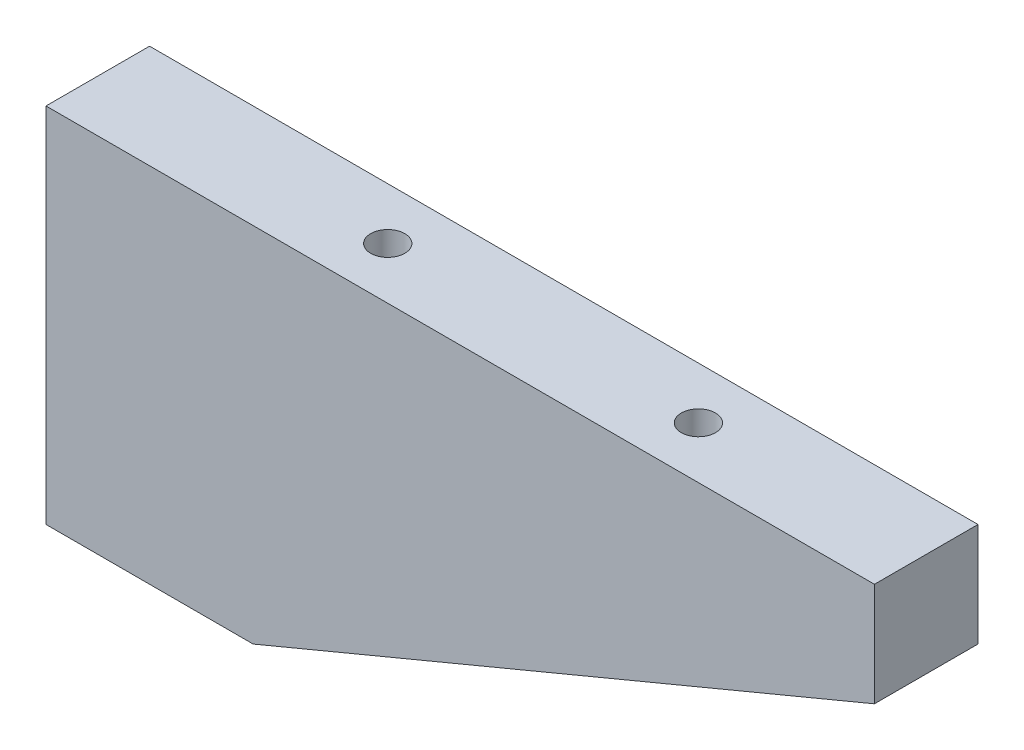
ISO-10303-21;
HEADER;
FILE_DESCRIPTION(('STEP AP214'),'2;1');
FILE_NAME('part.step','',(''),(''),'','','');
FILE_SCHEMA(('AUTOMOTIVE_DESIGN { 1 0 10303 214 1 1 1 1 }'));
ENDSEC;
DATA;
#1=APPLICATION_CONTEXT('core data for automotive mechanical design processes');
#2=APPLICATION_PROTOCOL_DEFINITION('international standard','automotive_design',2000,#1);
#3=PRODUCT_CONTEXT('',#1,'mechanical');
#4=PRODUCT('Part','Part','',(#3));
#5=PRODUCT_RELATED_PRODUCT_CATEGORY('part','',(#4));
#6=PRODUCT_DEFINITION_FORMATION('','',#4);
#7=PRODUCT_DEFINITION_CONTEXT('part definition',#1,'design');
#8=PRODUCT_DEFINITION('design','',#6,#7);
#9=PRODUCT_DEFINITION_SHAPE('','',#8);
#10=(LENGTH_UNIT() NAMED_UNIT(*) SI_UNIT(.MILLI.,.METRE.));
#11=(NAMED_UNIT(*) PLANE_ANGLE_UNIT() SI_UNIT($,.RADIAN.));
#12=(NAMED_UNIT(*) SI_UNIT($,.STERADIAN.) SOLID_ANGLE_UNIT());
#13=UNCERTAINTY_MEASURE_WITH_UNIT(LENGTH_MEASURE(1.E-05),#10,'distance_accuracy_value','');
#14=(GEOMETRIC_REPRESENTATION_CONTEXT(3) GLOBAL_UNCERTAINTY_ASSIGNED_CONTEXT((#13)) GLOBAL_UNIT_ASSIGNED_CONTEXT((#10,
#11,#12)) REPRESENTATION_CONTEXT('',''));
#15=CARTESIAN_POINT('',(0.,0.,0.));
#16=DIRECTION('',(0.,0.,1.));
#17=DIRECTION('',(1.,0.,0.));
#18=AXIS2_PLACEMENT_3D('',#15,#16,#17);
#19=CARTESIAN_POINT('',(0.,31.6094189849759,10.));
#20=DIRECTION('',(1.,0.,0.));
#21=DIRECTION('',(0.,1.,0.));
#22=AXIS2_PLACEMENT_3D('',#19,#20,#21);
#23=PLANE('',#22);
#24=CARTESIAN_POINT('',(0.,4.60941898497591,5.));
#25=DIRECTION('',(-1.,0.,0.));
#26=DIRECTION('',(0.,0.,1.));
#27=AXIS2_PLACEMENT_3D('',#24,#25,#26);
#28=CIRCLE('',#27,1.65);
#29=CARTESIAN_POINT('',(0.,4.60941898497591,6.65));
#30=VERTEX_POINT('',#29);
#31=EDGE_CURVE('E135',#30,#30,#28,.T.);
#32=ORIENTED_EDGE('',*,*,#31,.F.);
#33=EDGE_LOOP('',(#32));
#34=FACE_BOUND('',#33,.T.);
#35=CARTESIAN_POINT('',(0.,24.6094189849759,5.));
#36=DIRECTION('',(-1.,0.,0.));
#37=DIRECTION('',(0.,0.,1.));
#38=AXIS2_PLACEMENT_3D('',#35,#36,#37);
#39=CIRCLE('',#38,1.65);
#40=CARTESIAN_POINT('',(0.,24.6094189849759,6.65));
#41=VERTEX_POINT('',#40);
#42=EDGE_CURVE('E138',#41,#41,#39,.T.);
#43=ORIENTED_EDGE('',*,*,#42,.F.);
#44=EDGE_LOOP('',(#43));
#45=FACE_BOUND('',#44,.T.);
#46=DIRECTION('',(0.,-1.,0.));
#47=VECTOR('',#46,1.);
#48=CARTESIAN_POINT('',(0.,31.6094189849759,0.));
#49=LINE('',#48,#47);
#50=CARTESIAN_POINT('',(0.,31.6094189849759,0.));
#51=VERTEX_POINT('',#50);
#52=CARTESIAN_POINT('',(0.,-3.39058101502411,0.));
#53=VERTEX_POINT('',#52);
#54=EDGE_CURVE('E93',#51,#53,#49,.T.);
#55=ORIENTED_EDGE('',*,*,#54,.T.);
#56=DIRECTION('',(0.,0.,-1.));
#57=VECTOR('',#56,1.);
#58=CARTESIAN_POINT('',(0.,-3.39058101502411,10.));
#59=LINE('',#58,#57);
#60=CARTESIAN_POINT('',(0.,-3.39058101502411,10.));
#61=VERTEX_POINT('',#60);
#62=EDGE_CURVE('E11',#61,#53,#59,.T.);
#63=ORIENTED_EDGE('',*,*,#62,.F.);
#64=DIRECTION('',(0.,-1.,0.));
#65=VECTOR('',#64,1.);
#66=CARTESIAN_POINT('',(0.,31.6094189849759,10.));
#67=LINE('',#66,#65);
#68=CARTESIAN_POINT('',(0.,31.6094189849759,10.));
#69=VERTEX_POINT('',#68);
#70=EDGE_CURVE('E102',#69,#61,#67,.T.);
#71=ORIENTED_EDGE('',*,*,#70,.F.);
#72=DIRECTION('',(0.,0.,-1.));
#73=VECTOR('',#72,1.);
#74=CARTESIAN_POINT('',(0.,31.6094189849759,10.));
#75=LINE('',#74,#73);
#76=EDGE_CURVE('E89',#69,#51,#75,.T.);
#77=ORIENTED_EDGE('',*,*,#76,.T.);
#78=EDGE_LOOP('',(#55,#63,#71,#77));
#79=FACE_BOUND('',#78,.T.);
#80=ADVANCED_FACE('F16',(#34,#45,#79),#23,.F.);
#81=CARTESIAN_POINT('',(0.,-3.39058101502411,10.));
#82=DIRECTION('',(0.,1.,0.));
#83=DIRECTION('',(0.,0.,1.));
#84=AXIS2_PLACEMENT_3D('',#81,#82,#83);
#85=PLANE('',#84);
#86=DIRECTION('',(1.,0.,0.));
#87=VECTOR('',#86,1.);
#88=CARTESIAN_POINT('',(0.,-3.39058101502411,0.));
#89=LINE('',#88,#87);
#90=CARTESIAN_POINT('',(20.,-3.39058101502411,0.));
#91=VERTEX_POINT('',#90);
#92=EDGE_CURVE('E96',#53,#91,#89,.T.);
#93=ORIENTED_EDGE('',*,*,#92,.T.);
#94=DIRECTION('',(0.,0.,-1.));
#95=VECTOR('',#94,1.);
#96=CARTESIAN_POINT('',(20.,-3.39058101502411,10.));
#97=LINE('',#96,#95);
#98=CARTESIAN_POINT('',(20.,-3.39058101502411,10.));
#99=VERTEX_POINT('',#98);
#100=EDGE_CURVE('E24',#99,#91,#97,.T.);
#101=ORIENTED_EDGE('',*,*,#100,.F.);
#102=DIRECTION('',(1.,0.,0.));
#103=VECTOR('',#102,1.);
#104=CARTESIAN_POINT('',(0.,-3.39058101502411,10.));
#105=LINE('',#104,#103);
#106=EDGE_CURVE('E67',#61,#99,#105,.T.);
#107=ORIENTED_EDGE('',*,*,#106,.F.);
#108=ORIENTED_EDGE('',*,*,#62,.T.);
#109=EDGE_LOOP('',(#93,#101,#107,#108));
#110=FACE_BOUND('',#109,.T.);
#111=ADVANCED_FACE('F126',(#110),#85,.F.);
#112=CARTESIAN_POINT('',(80.,21.6094189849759,10.));
#113=DIRECTION('',(-0.384615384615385,0.923076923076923,0.));
#114=DIRECTION('',(-0.923076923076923,-0.384615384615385,0.));
#115=AXIS2_PLACEMENT_3D('',#112,#113,#114);
#116=PLANE('',#115);
#117=DIRECTION('',(0.923076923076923,0.384615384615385,0.));
#118=VECTOR('',#117,1.);
#119=CARTESIAN_POINT('',(80.,21.6094189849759,0.));
#120=LINE('',#119,#118);
#121=CARTESIAN_POINT('',(80.,21.6094189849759,0.));
#122=VERTEX_POINT('',#121);
#123=EDGE_CURVE('E84',#91,#122,#120,.T.);
#124=ORIENTED_EDGE('',*,*,#123,.T.);
#125=DIRECTION('',(0.,0.,-1.));
#126=VECTOR('',#125,1.);
#127=CARTESIAN_POINT('',(80.,21.6094189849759,10.));
#128=LINE('',#127,#126);
#129=CARTESIAN_POINT('',(80.,21.6094189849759,10.));
#130=VERTEX_POINT('',#129);
#131=EDGE_CURVE('E81',#130,#122,#128,.T.);
#132=ORIENTED_EDGE('',*,*,#131,.F.);
#133=DIRECTION('',(0.923076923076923,0.384615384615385,0.));
#134=VECTOR('',#133,1.);
#135=CARTESIAN_POINT('',(80.,21.6094189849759,10.));
#136=LINE('',#135,#134);
#137=EDGE_CURVE('E73',#99,#130,#136,.T.);
#138=ORIENTED_EDGE('',*,*,#137,.F.);
#139=ORIENTED_EDGE('',*,*,#100,.T.);
#140=EDGE_LOOP('',(#124,#132,#138,#139));
#141=FACE_BOUND('',#140,.T.);
#142=ADVANCED_FACE('F82',(#141),#116,.F.);
#143=CARTESIAN_POINT('',(80.,31.6094189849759,10.));
#144=DIRECTION('',(-1.,0.,0.));
#145=DIRECTION('',(0.,0.,1.));
#146=AXIS2_PLACEMENT_3D('',#143,#144,#145);
#147=PLANE('',#146);
#148=DIRECTION('',(0.,1.,0.));
#149=VECTOR('',#148,1.);
#150=CARTESIAN_POINT('',(80.,31.6094189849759,0.));
#151=LINE('',#150,#149);
#152=CARTESIAN_POINT('',(80.,31.6094189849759,0.));
#153=VERTEX_POINT('',#152);
#154=EDGE_CURVE('E53',#122,#153,#151,.T.);
#155=ORIENTED_EDGE('',*,*,#154,.T.);
#156=DIRECTION('',(0.,0.,-1.));
#157=VECTOR('',#156,1.);
#158=CARTESIAN_POINT('',(80.,31.6094189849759,10.));
#159=LINE('',#158,#157);
#160=CARTESIAN_POINT('',(80.,31.6094189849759,10.));
#161=VERTEX_POINT('',#160);
#162=EDGE_CURVE('E85',#161,#153,#159,.T.);
#163=ORIENTED_EDGE('',*,*,#162,.F.);
#164=DIRECTION('',(0.,1.,0.));
#165=VECTOR('',#164,1.);
#166=CARTESIAN_POINT('',(80.,31.6094189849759,10.));
#167=LINE('',#166,#165);
#168=EDGE_CURVE('E77',#130,#161,#167,.T.);
#169=ORIENTED_EDGE('',*,*,#168,.F.);
#170=ORIENTED_EDGE('',*,*,#131,.T.);
#171=EDGE_LOOP('',(#155,#163,#169,#170));
#172=FACE_BOUND('',#171,.T.);
#173=ADVANCED_FACE('F87',(#172),#147,.F.);
#174=CARTESIAN_POINT('',(0.,31.6094189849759,10.));
#175=DIRECTION('',(0.,-1.,0.));
#176=DIRECTION('',(0.,0.,-1.));
#177=AXIS2_PLACEMENT_3D('',#174,#175,#176);
#178=PLANE('',#177);
#179=CARTESIAN_POINT('',(58.,31.6094189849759,5.));
#180=DIRECTION('',(0.,1.,0.));
#181=DIRECTION('',(0.,0.,1.));
#182=AXIS2_PLACEMENT_3D('',#179,#180,#181);
#183=CIRCLE('',#182,1.65);
#184=CARTESIAN_POINT('',(58.,31.6094189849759,6.65));
#185=VERTEX_POINT('',#184);
#186=EDGE_CURVE('E144',#185,#185,#183,.T.);
#187=ORIENTED_EDGE('',*,*,#186,.F.);
#188=EDGE_LOOP('',(#187));
#189=FACE_BOUND('',#188,.T.);
#190=CARTESIAN_POINT('',(28.,31.6094189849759,5.));
#191=DIRECTION('',(0.,1.,0.));
#192=DIRECTION('',(0.,0.,1.));
#193=AXIS2_PLACEMENT_3D('',#190,#191,#192);
#194=CIRCLE('',#193,1.65);
#195=CARTESIAN_POINT('',(28.,31.6094189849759,6.65));
#196=VERTEX_POINT('',#195);
#197=EDGE_CURVE('E155',#196,#196,#194,.T.);
#198=ORIENTED_EDGE('',*,*,#197,.F.);
#199=EDGE_LOOP('',(#198));
#200=FACE_BOUND('',#199,.T.);
#201=DIRECTION('',(-1.,0.,0.));
#202=VECTOR('',#201,1.);
#203=CARTESIAN_POINT('',(0.,31.6094189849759,0.));
#204=LINE('',#203,#202);
#205=EDGE_CURVE('E59',#153,#51,#204,.T.);
#206=ORIENTED_EDGE('',*,*,#205,.T.);
#207=ORIENTED_EDGE('',*,*,#76,.F.);
#208=DIRECTION('',(-1.,0.,0.));
#209=VECTOR('',#208,1.);
#210=CARTESIAN_POINT('',(0.,31.6094189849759,10.));
#211=LINE('',#210,#209);
#212=EDGE_CURVE('E32',#161,#69,#211,.T.);
#213=ORIENTED_EDGE('',*,*,#212,.F.);
#214=ORIENTED_EDGE('',*,*,#162,.T.);
#215=EDGE_LOOP('',(#206,#207,#213,#214));
#216=FACE_BOUND('',#215,.T.);
#217=ADVANCED_FACE('F110',(#189,#200,#216),#178,.F.);
#218=CARTESIAN_POINT('',(0.,0.,10.));
#219=DIRECTION('',(0.,0.,1.));
#220=DIRECTION('',(1.,0.,0.));
#221=AXIS2_PLACEMENT_3D('',#218,#219,#220);
#222=PLANE('',#221);
#223=ORIENTED_EDGE('',*,*,#70,.T.);
#224=ORIENTED_EDGE('',*,*,#106,.T.);
#225=ORIENTED_EDGE('',*,*,#137,.T.);
#226=ORIENTED_EDGE('',*,*,#168,.T.);
#227=ORIENTED_EDGE('',*,*,#212,.T.);
#228=EDGE_LOOP('',(#223,#224,#225,#226,#227));
#229=FACE_BOUND('',#228,.T.);
#230=ADVANCED_FACE('F75',(#229),#222,.T.);
#231=CARTESIAN_POINT('',(0.,0.,0.));
#232=DIRECTION('',(0.,0.,1.));
#233=DIRECTION('',(1.,0.,0.));
#234=AXIS2_PLACEMENT_3D('',#231,#232,#233);
#235=PLANE('',#234);
#236=ORIENTED_EDGE('',*,*,#54,.F.);
#237=ORIENTED_EDGE('',*,*,#205,.F.);
#238=ORIENTED_EDGE('',*,*,#154,.F.);
#239=ORIENTED_EDGE('',*,*,#123,.F.);
#240=ORIENTED_EDGE('',*,*,#92,.F.);
#241=EDGE_LOOP('',(#236,#237,#238,#239,#240));
#242=FACE_BOUND('',#241,.T.);
#243=ADVANCED_FACE('F106',(#242),#235,.F.);
#244=CARTESIAN_POINT('',(28.,16.1094189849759,5.));
#245=DIRECTION('',(0.,1.,0.));
#246=DIRECTION('',(0.,0.,1.));
#247=AXIS2_PLACEMENT_3D('',#244,#245,#246);
#248=CONICAL_SURFACE('',#247,1.65,1.02974425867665);
#249=CARTESIAN_POINT('',(28.,15.1179989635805,5.));
#250=VERTEX_POINT('',#249);
#251=VERTEX_LOOP('',#250);
#252=FACE_BOUND('',#251,.T.);
#253=CARTESIAN_POINT('',(28.,16.1094189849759,5.));
#254=DIRECTION('',(0.,1.,0.));
#255=DIRECTION('',(0.,0.,1.));
#256=AXIS2_PLACEMENT_3D('',#253,#254,#255);
#257=CIRCLE('',#256,1.65);
#258=CARTESIAN_POINT('',(28.,16.1094189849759,6.65));
#259=VERTEX_POINT('',#258);
#260=EDGE_CURVE('E97',#259,#259,#257,.T.);
#261=ORIENTED_EDGE('',*,*,#260,.T.);
#262=EDGE_LOOP('',(#261));
#263=FACE_BOUND('',#262,.T.);
#264=ADVANCED_FACE('F162',(#252,#263),#248,.F.);
#265=CARTESIAN_POINT('',(28.,31.6094189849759,5.));
#266=DIRECTION('',(0.,1.,0.));
#267=DIRECTION('',(0.,0.,1.));
#268=AXIS2_PLACEMENT_3D('',#265,#266,#267);
#269=CYLINDRICAL_SURFACE('',#268,1.65);
#270=ORIENTED_EDGE('',*,*,#260,.F.);
#271=EDGE_LOOP('',(#270));
#272=FACE_BOUND('',#271,.T.);
#273=ORIENTED_EDGE('',*,*,#197,.T.);
#274=EDGE_LOOP('',(#273));
#275=FACE_BOUND('',#274,.T.);
#276=ADVANCED_FACE('F164',(#272,#275),#269,.F.);
#277=CARTESIAN_POINT('',(58.,16.1094189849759,5.));
#278=DIRECTION('',(0.,1.,0.));
#279=DIRECTION('',(0.,0.,1.));
#280=AXIS2_PLACEMENT_3D('',#277,#278,#279);
#281=CONICAL_SURFACE('',#280,1.65,1.02974425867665);
#282=CARTESIAN_POINT('',(58.,15.1179989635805,5.));
#283=VERTEX_POINT('',#282);
#284=VERTEX_LOOP('',#283);
#285=FACE_BOUND('',#284,.T.);
#286=CARTESIAN_POINT('',(58.,16.1094189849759,5.));
#287=DIRECTION('',(0.,1.,0.));
#288=DIRECTION('',(0.,0.,1.));
#289=AXIS2_PLACEMENT_3D('',#286,#287,#288);
#290=CIRCLE('',#289,1.65);
#291=CARTESIAN_POINT('',(58.,16.1094189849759,6.65));
#292=VERTEX_POINT('',#291);
#293=EDGE_CURVE('E152',#292,#292,#290,.T.);
#294=ORIENTED_EDGE('',*,*,#293,.T.);
#295=EDGE_LOOP('',(#294));
#296=FACE_BOUND('',#295,.T.);
#297=ADVANCED_FACE('F167',(#285,#296),#281,.F.);
#298=CARTESIAN_POINT('',(58.,31.6094189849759,5.));
#299=DIRECTION('',(0.,1.,0.));
#300=DIRECTION('',(0.,0.,1.));
#301=AXIS2_PLACEMENT_3D('',#298,#299,#300);
#302=CYLINDRICAL_SURFACE('',#301,1.65);
#303=ORIENTED_EDGE('',*,*,#293,.F.);
#304=EDGE_LOOP('',(#303));
#305=FACE_BOUND('',#304,.T.);
#306=ORIENTED_EDGE('',*,*,#186,.T.);
#307=EDGE_LOOP('',(#306));
#308=FACE_BOUND('',#307,.T.);
#309=ADVANCED_FACE('F175',(#305,#308),#302,.F.);
#310=CARTESIAN_POINT('',(15.5,24.6094189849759,5.));
#311=DIRECTION('',(-1.,0.,0.));
#312=DIRECTION('',(0.,0.,1.));
#313=AXIS2_PLACEMENT_3D('',#310,#311,#312);
#314=CONICAL_SURFACE('',#313,1.65,1.02974425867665);
#315=CARTESIAN_POINT('',(16.4914200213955,24.6094189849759,5.));
#316=VERTEX_POINT('',#315);
#317=VERTEX_LOOP('',#316);
#318=FACE_BOUND('',#317,.T.);
#319=CARTESIAN_POINT('',(15.5,24.6094189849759,5.));
#320=DIRECTION('',(-1.,0.,0.));
#321=DIRECTION('',(0.,0.,1.));
#322=AXIS2_PLACEMENT_3D('',#319,#320,#321);
#323=CIRCLE('',#322,1.65);
#324=CARTESIAN_POINT('',(15.5,24.6094189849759,6.65));
#325=VERTEX_POINT('',#324);
#326=EDGE_CURVE('E140',#325,#325,#323,.T.);
#327=ORIENTED_EDGE('',*,*,#326,.T.);
#328=EDGE_LOOP('',(#327));
#329=FACE_BOUND('',#328,.T.);
#330=ADVANCED_FACE('F215',(#318,#329),#314,.F.);
#331=CARTESIAN_POINT('',(0.,24.6094189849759,5.));
#332=DIRECTION('',(-1.,0.,0.));
#333=DIRECTION('',(0.,0.,1.));
#334=AXIS2_PLACEMENT_3D('',#331,#332,#333);
#335=CYLINDRICAL_SURFACE('',#334,1.65);
#336=ORIENTED_EDGE('',*,*,#326,.F.);
#337=EDGE_LOOP('',(#336));
#338=FACE_BOUND('',#337,.T.);
#339=ORIENTED_EDGE('',*,*,#42,.T.);
#340=EDGE_LOOP('',(#339));
#341=FACE_BOUND('',#340,.T.);
#342=ADVANCED_FACE('F224',(#338,#341),#335,.F.);
#343=CARTESIAN_POINT('',(15.5,4.60941898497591,5.));
#344=DIRECTION('',(-1.,0.,0.));
#345=DIRECTION('',(0.,0.,1.));
#346=AXIS2_PLACEMENT_3D('',#343,#344,#345);
#347=CONICAL_SURFACE('',#346,1.65,1.02974425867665);
#348=CARTESIAN_POINT('',(16.4914200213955,4.6094189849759,5.));
#349=VERTEX_POINT('',#348);
#350=VERTEX_LOOP('',#349);
#351=FACE_BOUND('',#350,.T.);
#352=CARTESIAN_POINT('',(15.5,4.60941898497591,5.));
#353=DIRECTION('',(-1.,0.,0.));
#354=DIRECTION('',(0.,0.,1.));
#355=AXIS2_PLACEMENT_3D('',#352,#353,#354);
#356=CIRCLE('',#355,1.65);
#357=CARTESIAN_POINT('',(15.5,4.60941898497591,6.65));
#358=VERTEX_POINT('',#357);
#359=EDGE_CURVE('E141',#358,#358,#356,.T.);
#360=ORIENTED_EDGE('',*,*,#359,.T.);
#361=EDGE_LOOP('',(#360));
#362=FACE_BOUND('',#361,.T.);
#363=ADVANCED_FACE('F234',(#351,#362),#347,.F.);
#364=CARTESIAN_POINT('',(0.,4.60941898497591,5.));
#365=DIRECTION('',(-1.,0.,0.));
#366=DIRECTION('',(0.,0.,1.));
#367=AXIS2_PLACEMENT_3D('',#364,#365,#366);
#368=CYLINDRICAL_SURFACE('',#367,1.65);
#369=ORIENTED_EDGE('',*,*,#359,.F.);
#370=EDGE_LOOP('',(#369));
#371=FACE_BOUND('',#370,.T.);
#372=ORIENTED_EDGE('',*,*,#31,.T.);
#373=EDGE_LOOP('',(#372));
#374=FACE_BOUND('',#373,.T.);
#375=ADVANCED_FACE('F244',(#371,#374),#368,.F.);
#376=CLOSED_SHELL('',(#80,#111,#142,#173,#217,#230,#243,#264,#276,#297,#309,#330,#342,#363,#375));
#377=MANIFOLD_SOLID_BREP('B1',#376);
#378=ADVANCED_BREP_SHAPE_REPRESENTATION('',(#18,#377),#14);
#379=SHAPE_DEFINITION_REPRESENTATION(#9,#378);
ENDSEC;
END-ISO-10303-21;
